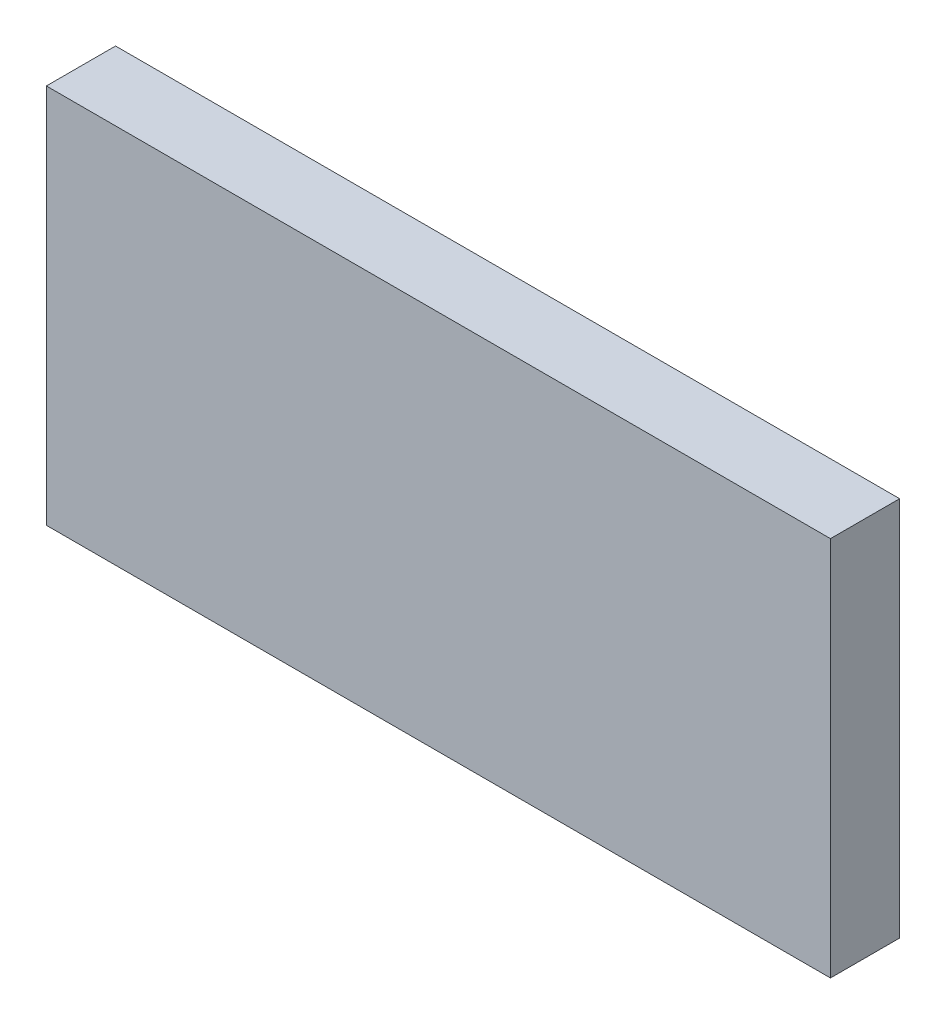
ISO-10303-21;
HEADER;
FILE_DESCRIPTION(('STEP AP214'),'2;1');
FILE_NAME('part.step','',(''),(''),'','','');
FILE_SCHEMA(('AUTOMOTIVE_DESIGN { 1 0 10303 214 1 1 1 1 }'));
ENDSEC;
DATA;
#1=APPLICATION_CONTEXT('core data for automotive mechanical design processes');
#2=APPLICATION_PROTOCOL_DEFINITION('international standard','automotive_design',2000,#1);
#3=PRODUCT_CONTEXT('',#1,'mechanical');
#4=PRODUCT('Part','Part','',(#3));
#5=PRODUCT_RELATED_PRODUCT_CATEGORY('part','',(#4));
#6=PRODUCT_DEFINITION_FORMATION('','',#4);
#7=PRODUCT_DEFINITION_CONTEXT('part definition',#1,'design');
#8=PRODUCT_DEFINITION('design','',#6,#7);
#9=PRODUCT_DEFINITION_SHAPE('','',#8);
#10=(LENGTH_UNIT() NAMED_UNIT(*) SI_UNIT(.MILLI.,.METRE.));
#11=(NAMED_UNIT(*) PLANE_ANGLE_UNIT() SI_UNIT($,.RADIAN.));
#12=(NAMED_UNIT(*) SI_UNIT($,.STERADIAN.) SOLID_ANGLE_UNIT());
#13=UNCERTAINTY_MEASURE_WITH_UNIT(LENGTH_MEASURE(1.E-05),#10,'distance_accuracy_value','');
#14=(GEOMETRIC_REPRESENTATION_CONTEXT(3) GLOBAL_UNCERTAINTY_ASSIGNED_CONTEXT((#13)) GLOBAL_UNIT_ASSIGNED_CONTEXT((#10,
#11,#12)) REPRESENTATION_CONTEXT('',''));
#15=CARTESIAN_POINT('',(0.,0.,0.));
#16=DIRECTION('',(0.,0.,1.));
#17=DIRECTION('',(1.,0.,0.));
#18=AXIS2_PLACEMENT_3D('',#15,#16,#17);
#19=CARTESIAN_POINT('',(0.,0.,6.));
#20=DIRECTION('',(1.,0.,0.));
#21=DIRECTION('',(0.,0.,-1.));
#22=AXIS2_PLACEMENT_3D('',#19,#20,#21);
#23=PLANE('',#22);
#24=DIRECTION('',(0.,-1.,0.));
#25=VECTOR('',#24,1.);
#26=CARTESIAN_POINT('',(0.,0.,0.));
#27=LINE('',#26,#25);
#28=CARTESIAN_POINT('',(0.,33.,0.));
#29=VERTEX_POINT('',#28);
#30=CARTESIAN_POINT('',(0.,0.,0.));
#31=VERTEX_POINT('',#30);
#32=EDGE_CURVE('E74',#29,#31,#27,.T.);
#33=ORIENTED_EDGE('',*,*,#32,.T.);
#34=DIRECTION('',(0.,0.,-1.));
#35=VECTOR('',#34,1.);
#36=CARTESIAN_POINT('',(0.,0.,6.));
#37=LINE('',#36,#35);
#38=CARTESIAN_POINT('',(0.,0.,6.));
#39=VERTEX_POINT('',#38);
#40=EDGE_CURVE('E11',#39,#31,#37,.T.);
#41=ORIENTED_EDGE('',*,*,#40,.F.);
#42=DIRECTION('',(0.,-1.,0.));
#43=VECTOR('',#42,1.);
#44=CARTESIAN_POINT('',(0.,0.,6.));
#45=LINE('',#44,#43);
#46=CARTESIAN_POINT('',(0.,33.,6.));
#47=VERTEX_POINT('',#46);
#48=EDGE_CURVE('E92',#47,#39,#45,.T.);
#49=ORIENTED_EDGE('',*,*,#48,.F.);
#50=DIRECTION('',(0.,0.,-1.));
#51=VECTOR('',#50,1.);
#52=CARTESIAN_POINT('',(0.,33.,6.));
#53=LINE('',#52,#51);
#54=EDGE_CURVE('E86',#47,#29,#53,.T.);
#55=ORIENTED_EDGE('',*,*,#54,.T.);
#56=EDGE_LOOP('',(#33,#41,#49,#55));
#57=FACE_BOUND('',#56,.T.);
#58=ADVANCED_FACE('F30',(#57),#23,.F.);
#59=CARTESIAN_POINT('',(0.,0.,6.));
#60=DIRECTION('',(0.,1.,0.));
#61=DIRECTION('',(0.,0.,1.));
#62=AXIS2_PLACEMENT_3D('',#59,#60,#61);
#63=PLANE('',#62);
#64=DIRECTION('',(1.,0.,0.));
#65=VECTOR('',#64,1.);
#66=CARTESIAN_POINT('',(0.,0.,0.));
#67=LINE('',#66,#65);
#68=CARTESIAN_POINT('',(68.,0.,0.));
#69=VERTEX_POINT('',#68);
#70=EDGE_CURVE('E70',#31,#69,#67,.T.);
#71=ORIENTED_EDGE('',*,*,#70,.T.);
#72=DIRECTION('',(0.,0.,-1.));
#73=VECTOR('',#72,1.);
#74=CARTESIAN_POINT('',(68.,0.,6.));
#75=LINE('',#74,#73);
#76=CARTESIAN_POINT('',(68.,0.,6.));
#77=VERTEX_POINT('',#76);
#78=EDGE_CURVE('E37',#77,#69,#75,.T.);
#79=ORIENTED_EDGE('',*,*,#78,.F.);
#80=DIRECTION('',(1.,0.,0.));
#81=VECTOR('',#80,1.);
#82=CARTESIAN_POINT('',(0.,0.,6.));
#83=LINE('',#82,#81);
#84=EDGE_CURVE('E82',#39,#77,#83,.T.);
#85=ORIENTED_EDGE('',*,*,#84,.F.);
#86=ORIENTED_EDGE('',*,*,#40,.T.);
#87=EDGE_LOOP('',(#71,#79,#85,#86));
#88=FACE_BOUND('',#87,.T.);
#89=ADVANCED_FACE('F81',(#88),#63,.F.);
#90=CARTESIAN_POINT('',(68.,0.,6.));
#91=DIRECTION('',(-1.,0.,0.));
#92=DIRECTION('',(0.,0.,1.));
#93=AXIS2_PLACEMENT_3D('',#90,#91,#92);
#94=PLANE('',#93);
#95=DIRECTION('',(0.,1.,0.));
#96=VECTOR('',#95,1.);
#97=CARTESIAN_POINT('',(68.,0.,0.));
#98=LINE('',#97,#96);
#99=CARTESIAN_POINT('',(68.,33.,0.));
#100=VERTEX_POINT('',#99);
#101=EDGE_CURVE('E75',#69,#100,#98,.T.);
#102=ORIENTED_EDGE('',*,*,#101,.T.);
#103=DIRECTION('',(0.,0.,-1.));
#104=VECTOR('',#103,1.);
#105=CARTESIAN_POINT('',(68.,33.,6.));
#106=LINE('',#105,#104);
#107=CARTESIAN_POINT('',(68.,33.,6.));
#108=VERTEX_POINT('',#107);
#109=EDGE_CURVE('E98',#108,#100,#106,.T.);
#110=ORIENTED_EDGE('',*,*,#109,.F.);
#111=DIRECTION('',(0.,1.,0.));
#112=VECTOR('',#111,1.);
#113=CARTESIAN_POINT('',(68.,0.,6.));
#114=LINE('',#113,#112);
#115=EDGE_CURVE('E49',#77,#108,#114,.T.);
#116=ORIENTED_EDGE('',*,*,#115,.F.);
#117=ORIENTED_EDGE('',*,*,#78,.T.);
#118=EDGE_LOOP('',(#102,#110,#116,#117));
#119=FACE_BOUND('',#118,.T.);
#120=ADVANCED_FACE('F101',(#119),#94,.F.);
#121=CARTESIAN_POINT('',(0.,33.,6.));
#122=DIRECTION('',(0.,-1.,0.));
#123=DIRECTION('',(0.,0.,-1.));
#124=AXIS2_PLACEMENT_3D('',#121,#122,#123);
#125=PLANE('',#124);
#126=DIRECTION('',(-1.,0.,0.));
#127=VECTOR('',#126,1.);
#128=CARTESIAN_POINT('',(0.,33.,0.));
#129=LINE('',#128,#127);
#130=EDGE_CURVE('E90',#100,#29,#129,.T.);
#131=ORIENTED_EDGE('',*,*,#130,.T.);
#132=ORIENTED_EDGE('',*,*,#54,.F.);
#133=DIRECTION('',(-1.,0.,0.));
#134=VECTOR('',#133,1.);
#135=CARTESIAN_POINT('',(0.,33.,6.));
#136=LINE('',#135,#134);
#137=EDGE_CURVE('E44',#108,#47,#136,.T.);
#138=ORIENTED_EDGE('',*,*,#137,.F.);
#139=ORIENTED_EDGE('',*,*,#109,.T.);
#140=EDGE_LOOP('',(#131,#132,#138,#139));
#141=FACE_BOUND('',#140,.T.);
#142=ADVANCED_FACE('F103',(#141),#125,.F.);
#143=CARTESIAN_POINT('',(0.,33.,6.));
#144=DIRECTION('',(0.,0.,-1.));
#145=DIRECTION('',(-1.,0.,0.));
#146=AXIS2_PLACEMENT_3D('',#143,#144,#145);
#147=PLANE('',#146);
#148=ORIENTED_EDGE('',*,*,#48,.T.);
#149=ORIENTED_EDGE('',*,*,#84,.T.);
#150=ORIENTED_EDGE('',*,*,#115,.T.);
#151=ORIENTED_EDGE('',*,*,#137,.T.);
#152=EDGE_LOOP('',(#148,#149,#150,#151));
#153=FACE_BOUND('',#152,.T.);
#154=ADVANCED_FACE('F104',(#153),#147,.F.);
#155=CARTESIAN_POINT('',(0.,33.,0.));
#156=DIRECTION('',(0.,0.,-1.));
#157=DIRECTION('',(-1.,0.,0.));
#158=AXIS2_PLACEMENT_3D('',#155,#156,#157);
#159=PLANE('',#158);
#160=ORIENTED_EDGE('',*,*,#32,.F.);
#161=ORIENTED_EDGE('',*,*,#130,.F.);
#162=ORIENTED_EDGE('',*,*,#101,.F.);
#163=ORIENTED_EDGE('',*,*,#70,.F.);
#164=EDGE_LOOP('',(#160,#161,#162,#163));
#165=FACE_BOUND('',#164,.T.);
#166=ADVANCED_FACE('F71',(#165),#159,.T.);
#167=CLOSED_SHELL('',(#58,#89,#120,#142,#154,#166));
#168=MANIFOLD_SOLID_BREP('B2',#167);
#169=ADVANCED_BREP_SHAPE_REPRESENTATION('',(#18,#168),#14);
#170=SHAPE_DEFINITION_REPRESENTATION(#9,#169);
ENDSEC;
END-ISO-10303-21;
